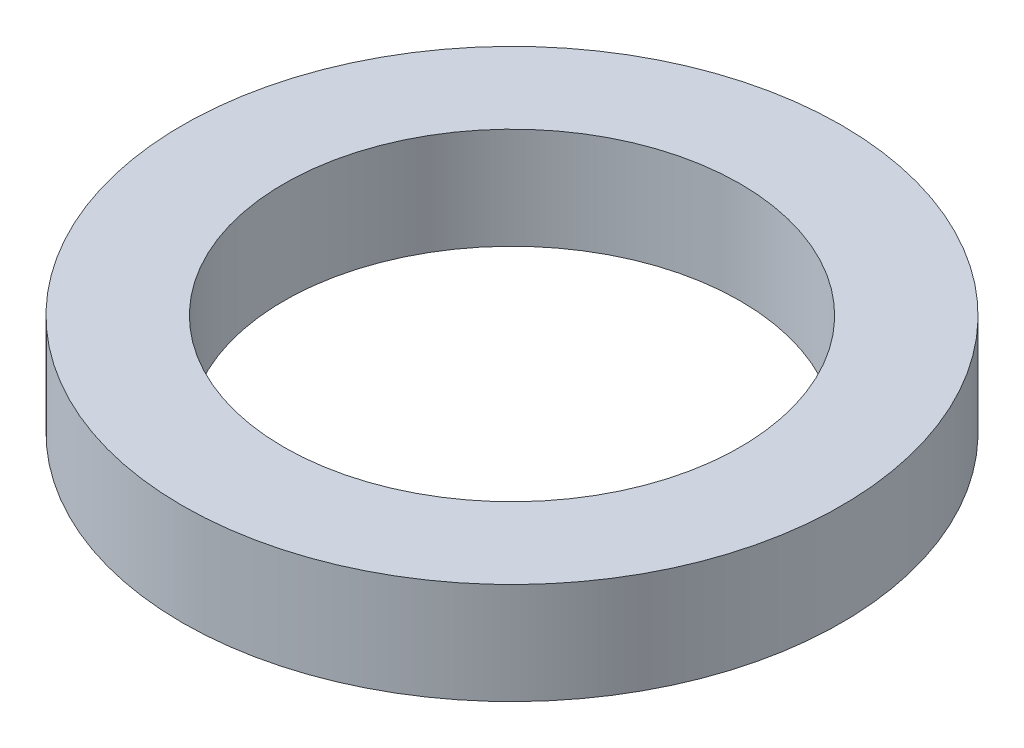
from build123d import *

# Parameters (mm, degrees)
ESQUISSE2_R          = 3.25
ESQUISSE2_R_2        = 2.25
BASE_EXTRUSION_DEPTH = 1


with BuildPart() as part:
    # Esquisse2 → Base-Extrusion (new body)
    with BuildSketch(Plane(origin=(0, 0, 0), x_dir=(1, 0, 0), z_dir=(0, 1, 0))):
        with Locations(Location((0, 0, 0), (0, 0, 270))):
            Circle(ESQUISSE2_R)
        with Locations(Location((0, 0, 0), (0, 0, 270))):
            Circle(ESQUISSE2_R_2, mode=Mode.SUBTRACT)
    extrude(amount=BASE_EXTRUSION_DEPTH)


solid = part.part
